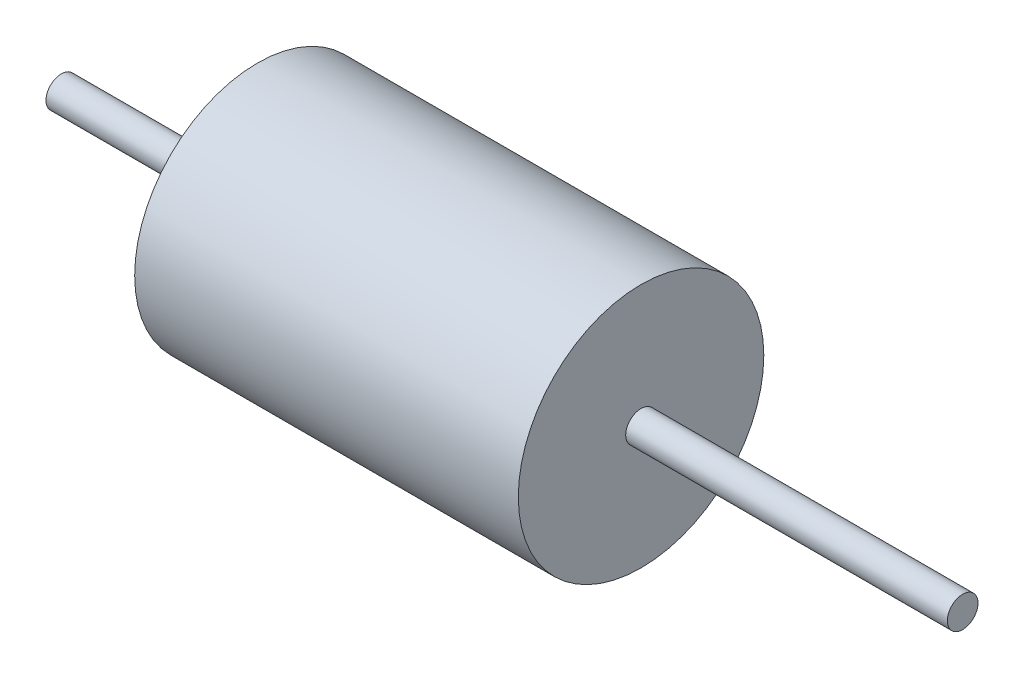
ISO-10303-21;
HEADER;
FILE_DESCRIPTION(('STEP AP214'),'2;1');
FILE_NAME('part.step','',(''),(''),'','','');
FILE_SCHEMA(('AUTOMOTIVE_DESIGN { 1 0 10303 214 1 1 1 1 }'));
ENDSEC;
DATA;
#1=APPLICATION_CONTEXT('core data for automotive mechanical design processes');
#2=APPLICATION_PROTOCOL_DEFINITION('international standard','automotive_design',2000,#1);
#3=PRODUCT_CONTEXT('',#1,'mechanical');
#4=PRODUCT('Part','Part','',(#3));
#5=PRODUCT_RELATED_PRODUCT_CATEGORY('part','',(#4));
#6=PRODUCT_DEFINITION_FORMATION('','',#4);
#7=PRODUCT_DEFINITION_CONTEXT('part definition',#1,'design');
#8=PRODUCT_DEFINITION('design','',#6,#7);
#9=PRODUCT_DEFINITION_SHAPE('','',#8);
#10=(LENGTH_UNIT() NAMED_UNIT(*) SI_UNIT(.MILLI.,.METRE.));
#11=(NAMED_UNIT(*) PLANE_ANGLE_UNIT() SI_UNIT($,.RADIAN.));
#12=(NAMED_UNIT(*) SI_UNIT($,.STERADIAN.) SOLID_ANGLE_UNIT());
#13=UNCERTAINTY_MEASURE_WITH_UNIT(LENGTH_MEASURE(1.E-05),#10,'distance_accuracy_value','');
#14=(GEOMETRIC_REPRESENTATION_CONTEXT(3) GLOBAL_UNCERTAINTY_ASSIGNED_CONTEXT((#13)) GLOBAL_UNIT_ASSIGNED_CONTEXT((#10,
#11,#12)) REPRESENTATION_CONTEXT('',''));
#15=CARTESIAN_POINT('',(0.,0.,0.));
#16=DIRECTION('',(0.,0.,1.));
#17=DIRECTION('',(1.,0.,0.));
#18=AXIS2_PLACEMENT_3D('',#15,#16,#17);
#19=CARTESIAN_POINT('',(220.790765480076,-199.,0.));
#20=DIRECTION('',(1.,0.,0.));
#21=DIRECTION('',(0.,1.,0.));
#22=AXIS2_PLACEMENT_3D('',#19,#20,#21);
#23=CYLINDRICAL_SURFACE('',#22,2.);
#24=CARTESIAN_POINT('',(97.4477799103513,-199.,0.));
#25=DIRECTION('',(1.,0.,0.));
#26=DIRECTION('',(0.,1.,0.));
#27=AXIS2_PLACEMENT_3D('',#24,#25,#26);
#28=CIRCLE('',#27,2.);
#29=CARTESIAN_POINT('',(97.4477799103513,-197.,0.));
#30=VERTEX_POINT('',#29);
#31=EDGE_CURVE('E10',#30,#30,#28,.F.);
#32=ORIENTED_EDGE('',*,*,#31,.F.);
#33=EDGE_LOOP('',(#32));
#34=FACE_BOUND('',#33,.T.);
#35=CARTESIAN_POINT('',(139.366679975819,-199.,0.));
#36=DIRECTION('',(1.,0.,0.));
#37=DIRECTION('',(0.,1.,0.));
#38=AXIS2_PLACEMENT_3D('',#35,#36,#37);
#39=CIRCLE('',#38,1.99999999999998);
#40=CARTESIAN_POINT('',(139.366679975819,-197.,0.));
#41=VERTEX_POINT('',#40);
#42=EDGE_CURVE('E373',#41,#41,#39,.T.);
#43=ORIENTED_EDGE('',*,*,#42,.F.);
#44=EDGE_LOOP('',(#43));
#45=FACE_BOUND('',#44,.T.);
#46=ADVANCED_FACE('F362',(#34,#45),#23,.T.);
#47=CARTESIAN_POINT('',(139.366679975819,-197.,0.));
#48=DIRECTION('',(1.,0.,0.));
#49=DIRECTION('',(0.,1.,0.));
#50=AXIS2_PLACEMENT_3D('',#47,#48,#49);
#51=PLANE('',#50);
#52=ORIENTED_EDGE('',*,*,#42,.T.);
#53=EDGE_LOOP('',(#52));
#54=FACE_BOUND('',#53,.T.);
#55=ADVANCED_FACE('F409',(#54),#51,.T.);
#56=CARTESIAN_POINT('',(97.4477799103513,-199.,0.));
#57=DIRECTION('',(-1.,0.,0.));
#58=DIRECTION('',(0.,-1.,0.));
#59=AXIS2_PLACEMENT_3D('',#56,#57,#58);
#60=CYLINDRICAL_SURFACE('',#59,16.);
#61=CARTESIAN_POINT('',(97.4477799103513,-199.,0.));
#62=DIRECTION('',(1.,0.,0.));
#63=DIRECTION('',(0.,1.,0.));
#64=AXIS2_PLACEMENT_3D('',#61,#62,#63);
#65=CIRCLE('',#64,16.);
#66=CARTESIAN_POINT('',(97.4477799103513,-183.,0.));
#67=VERTEX_POINT('',#66);
#68=EDGE_CURVE('E382',#67,#67,#65,.T.);
#69=ORIENTED_EDGE('',*,*,#68,.F.);
#70=EDGE_LOOP('',(#69));
#71=FACE_BOUND('',#70,.T.);
#72=CARTESIAN_POINT('',(47.4477799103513,-199.,0.));
#73=DIRECTION('',(1.,0.,0.));
#74=DIRECTION('',(0.,1.,0.));
#75=AXIS2_PLACEMENT_3D('',#72,#73,#74);
#76=CIRCLE('',#75,16.);
#77=CARTESIAN_POINT('',(47.4477799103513,-183.,0.));
#78=VERTEX_POINT('',#77);
#79=EDGE_CURVE('E386',#78,#78,#76,.T.);
#80=ORIENTED_EDGE('',*,*,#79,.T.);
#81=EDGE_LOOP('',(#80));
#82=FACE_BOUND('',#81,.T.);
#83=ADVANCED_FACE('F394',(#71,#82),#60,.T.);
#84=CARTESIAN_POINT('',(97.4477799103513,-199.,0.));
#85=DIRECTION('',(1.,0.,0.));
#86=DIRECTION('',(0.,1.,0.));
#87=AXIS2_PLACEMENT_3D('',#84,#85,#86);
#88=PLANE('',#87);
#89=ORIENTED_EDGE('',*,*,#31,.T.);
#90=EDGE_LOOP('',(#89));
#91=FACE_BOUND('',#90,.T.);
#92=ORIENTED_EDGE('',*,*,#68,.T.);
#93=EDGE_LOOP('',(#92));
#94=FACE_BOUND('',#93,.T.);
#95=ADVANCED_FACE('F398',(#91,#94),#88,.T.);
#96=CARTESIAN_POINT('',(47.4477799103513,-199.,0.));
#97=DIRECTION('',(1.,0.,0.));
#98=DIRECTION('',(0.,1.,0.));
#99=AXIS2_PLACEMENT_3D('',#96,#97,#98);
#100=PLANE('',#99);
#101=CARTESIAN_POINT('',(47.4477799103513,-199.,0.));
#102=DIRECTION('',(1.,0.,0.));
#103=DIRECTION('',(0.,1.,0.));
#104=AXIS2_PLACEMENT_3D('',#101,#102,#103);
#105=CIRCLE('',#104,2.);
#106=CARTESIAN_POINT('',(47.4477799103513,-197.,0.));
#107=VERTEX_POINT('',#106);
#108=EDGE_CURVE('E378',#107,#107,#105,.F.);
#109=ORIENTED_EDGE('',*,*,#108,.F.);
#110=EDGE_LOOP('',(#109));
#111=FACE_BOUND('',#110,.T.);
#112=ORIENTED_EDGE('',*,*,#79,.F.);
#113=EDGE_LOOP('',(#112));
#114=FACE_BOUND('',#113,.T.);
#115=ADVANCED_FACE('F396',(#111,#114),#100,.F.);
#116=CARTESIAN_POINT('',(21.8885502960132,-199.,0.));
#117=DIRECTION('',(-1.,0.,0.));
#118=DIRECTION('',(0.,-1.,0.));
#119=AXIS2_PLACEMENT_3D('',#116,#117,#118);
#120=PLANE('',#119);
#121=CARTESIAN_POINT('',(21.8885502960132,-199.,0.));
#122=DIRECTION('',(1.,0.,0.));
#123=DIRECTION('',(0.,1.,0.));
#124=AXIS2_PLACEMENT_3D('',#121,#122,#123);
#125=CIRCLE('',#124,2.00000000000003);
#126=CARTESIAN_POINT('',(21.8885502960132,-197.,0.));
#127=VERTEX_POINT('',#126);
#128=EDGE_CURVE('E369',#127,#127,#125,.T.);
#129=ORIENTED_EDGE('',*,*,#128,.F.);
#130=EDGE_LOOP('',(#129));
#131=FACE_BOUND('',#130,.T.);
#132=ADVANCED_FACE('F364',(#131),#120,.T.);
#133=ORIENTED_EDGE('',*,*,#128,.T.);
#134=EDGE_LOOP('',(#133));
#135=FACE_BOUND('',#134,.T.);
#136=ORIENTED_EDGE('',*,*,#108,.T.);
#137=EDGE_LOOP('',(#136));
#138=FACE_BOUND('',#137,.T.);
#139=ADVANCED_FACE('F405',(#135,#138),#23,.T.);
#140=CLOSED_SHELL('',(#46,#55,#83,#95,#115,#132,#139));
#141=MANIFOLD_SOLID_BREP('B2',#140);
#142=ADVANCED_BREP_SHAPE_REPRESENTATION('',(#18,#141),#14);
#143=SHAPE_DEFINITION_REPRESENTATION(#9,#142);
ENDSEC;
END-ISO-10303-21;
